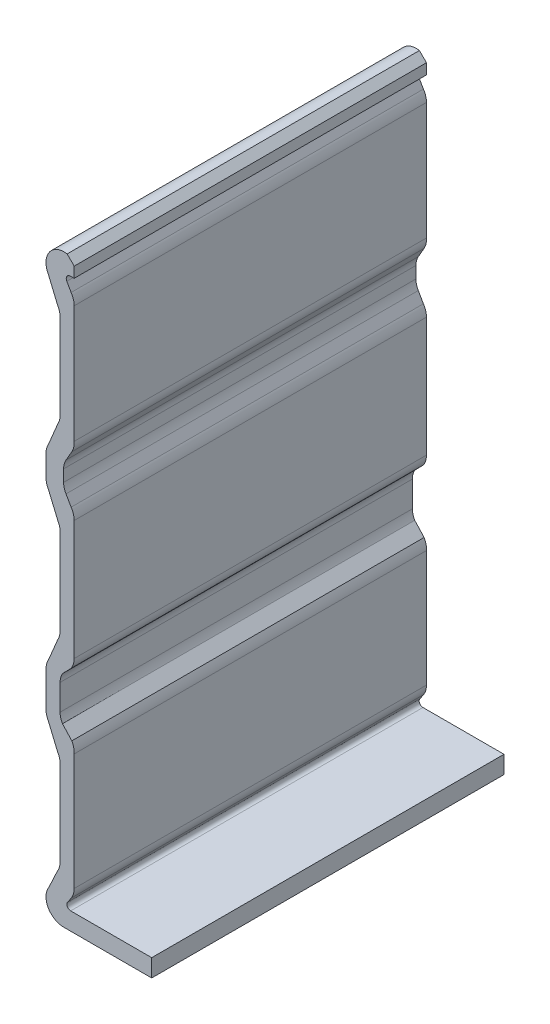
from build123d import *

# Parameters (mm, degrees)
EXTRUDE1_DEPTH = 50


with BuildPart() as part:
    # Sketch1 → Extrude1 (new, symmetric)
    with BuildSketch(Plane.XY):
        with BuildLine():
            Line((-22.670033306, 46.964433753), (-25.330306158, 49.840098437))
            ThreePointArc((-25.330306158, 49.840098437), (-25.829811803, 51.04601174), (-26.000183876, 52.340116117))
            Line((-26.000183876, 52.340116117), (-26.000183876, 59.660675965))
            ThreePointArc((-26.000183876, 59.660675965), (-25.829811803, 60.954780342), (-25.330306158, 62.160693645))
            Line((-25.330306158, 62.160693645), (-22.86509536, 64.698500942))
            ThreePointArc((-22.86509536, 64.698500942), (-22.225412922, 66.054283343), (-22.000155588, 67.53637601))
            Line((-22.000155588, 67.53637601), (-22.000155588, 101.464819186))
            ThreePointArc((-22.000155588, 101.464819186), (-22.225412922, 102.946911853), (-22.86509536, 104.302694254))
            Line((-22.86509536, 104.302694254), (-24.330299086, 106.84050155))
            ThreePointArc((-24.330299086, 106.84050155), (-24.829804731, 108.046414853), (-25.000176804, 109.340519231))
            Line((-25.000176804, 109.340519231), (-25.000176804, 112.661050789))
            ThreePointArc((-25.000176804, 112.661050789), (-24.829804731, 113.955155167), (-24.330299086, 115.16106847))
            Line((-24.330299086, 115.16106847), (-22.670033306, 118.036733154))
            ThreePointArc((-22.670033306, 118.036733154), (-22.128098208, 119.430283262), (-22.000155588, 120.920016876))
            Line((-22.000155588, 120.920016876), (-22.000155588, 154.244681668))
            ThreePointArc((-22.000155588, 154.244681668), (-22.225412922, 155.726774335), (-22.86509536, 157.082556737))
            Line((-22.86509536, 157.082556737), (-24.100237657, 159.22188595))
            ThreePointArc((-24.100237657, 159.22188595), (-24.100237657, 160.408054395), (-23.07298565, 161.001138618))
            Line((-23.07298565, 161.001138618), (-22.000155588, 161.001138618))
            Line((-22.000155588, 161.001138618), (-22.000155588, 164.001159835))
            Line((-22.000155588, 164.001159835), (-24.000169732, 166.001173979))
            ThreePointArc((-24.000169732, 166.001173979), (-28.24012533, 164.815972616), (-30.000212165, 160.780626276))
            ThreePointArc((-30.000212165, 160.780626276), (-29.829840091, 159.486521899), (-29.330334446, 158.280608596))
            Line((-29.330334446, 158.280608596), (-26.66953164, 151.940817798))
            ThreePointArc((-26.66953164, 151.940817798), (-26.160733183, 150.699711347), (-26.000183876, 149.368003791))
            Line((-26.000183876, 149.368003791), (-26.000183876, 125.413428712))
            ThreePointArc((-26.000183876, 125.413428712), (-26.160733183, 124.081721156), (-26.66953164, 122.840614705))
            Line((-26.66953164, 122.840614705), (-29.330334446, 116.500823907))
            ThreePointArc((-29.330334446, 116.500823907), (-29.829840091, 115.294910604), (-30.000212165, 114.000806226))
            Line((-30.000212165, 114.000806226), (-30.000212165, 108.000763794))
            ThreePointArc((-30.000212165, 108.000763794), (-29.829840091, 106.706659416), (-29.330334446, 105.500746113))
            Line((-29.330334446, 105.500746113), (-26.66953164, 99.160955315))
            ThreePointArc((-26.66953164, 99.160955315), (-26.170025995, 97.955042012), (-25.999653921, 96.660937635))
            Line((-25.999653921, 96.660937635), (-25.999653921, 72.340257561))
            ThreePointArc((-25.999653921, 72.340257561), (-26.170025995, 71.046153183), (-26.66953164, 69.84023988))
            Line((-26.66953164, 69.84023988), (-29.330334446, 63.500449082))
            ThreePointArc((-29.330334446, 63.500449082), (-29.829840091, 62.294535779), (-30.000212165, 61.000431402))
            Line((-30.000212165, 61.000431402), (-30.000212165, 51.00036068))
            ThreePointArc((-30.000212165, 51.00036068), (-29.829840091, 49.706256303), (-29.330334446, 48.500343))
            Line((-29.330334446, 48.500343), (-26.66953164, 42.160552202))
            ThreePointArc((-26.66953164, 42.160552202), (-26.160733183, 40.91944575), (-26.000183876, 39.587738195))
            Line((-26.000183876, 39.587738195), (-26.000183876, 15.58959129))
            ThreePointArc((-26.000183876, 15.58959129), (-26.204501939, 14.100273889), (-26.842262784, 12.73899754))
            Line((-26.842262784, 12.73899754), (-29.157603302, 7.777832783))
            ThreePointArc((-29.157603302, 7.777832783), (-29.409793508, 2.642996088), (-25.000176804, 0))
            Line((-25.000176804, 0), (0, 0))
            Line((0, 0), (0, 5.000035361))
            Line((0, 5.000035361), (-23.006893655, 5.000035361))
            ThreePointArc((-23.006893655, 5.000035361), (-23.946536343, 5.563229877), (-23.892797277, 6.657409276))
            Line((-23.892797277, 6.657409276), (-22.84276445, 8.228954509))
            ThreePointArc((-22.84276445, 8.228954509), (-22.215442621, 9.555360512), (-22.000155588, 11.006751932))
            Line((-22.000155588, 11.006751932), (-22.000155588, 44.081150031))
            ThreePointArc((-22.000155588, 44.081150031), (-22.128098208, 45.570883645), (-22.670033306, 46.964433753))
        make_face()
    extrude(amount=EXTRUDE1_DEPTH, both=True)


solid = part.part
